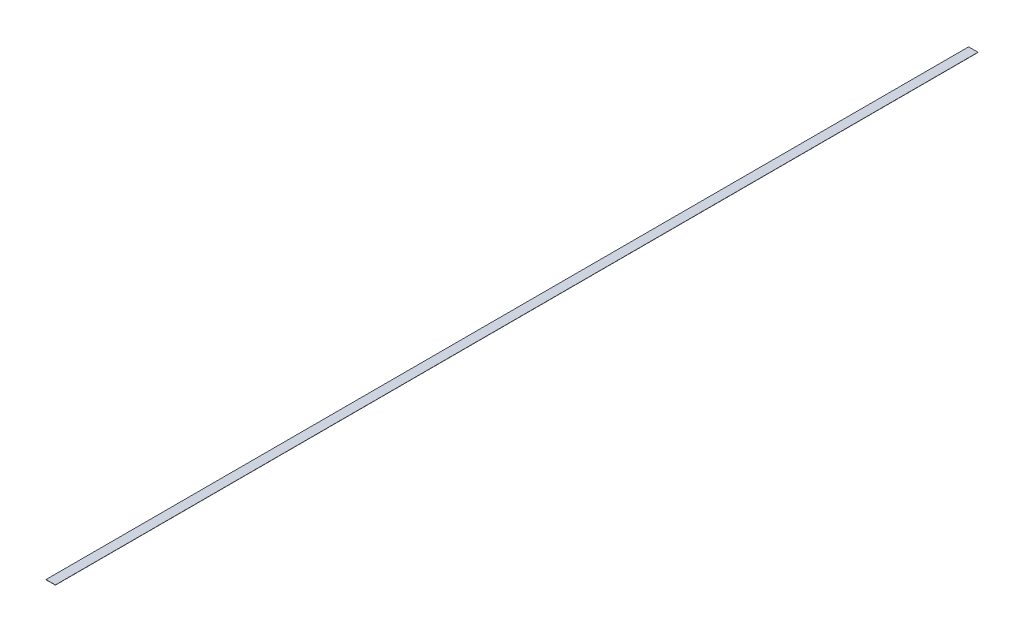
from build123d import *

# Parameters (mm, degrees)
SKETCH1_W           = 152.4
SKETCH1_H           = 14998.605584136
BOSS_EXTRUDE1_DEPTH = 3.175


with BuildPart() as part:
    # Sketch1 → Boss-Extrude1 (new body)
    with BuildSketch(Plane(origin=(0, 0, 0), x_dir=(1, 0, 0), z_dir=(0, 1, 0))):
        Rectangle(SKETCH1_W, SKETCH1_H)
    extrude(amount=BOSS_EXTRUDE1_DEPTH)


solid = part.part
